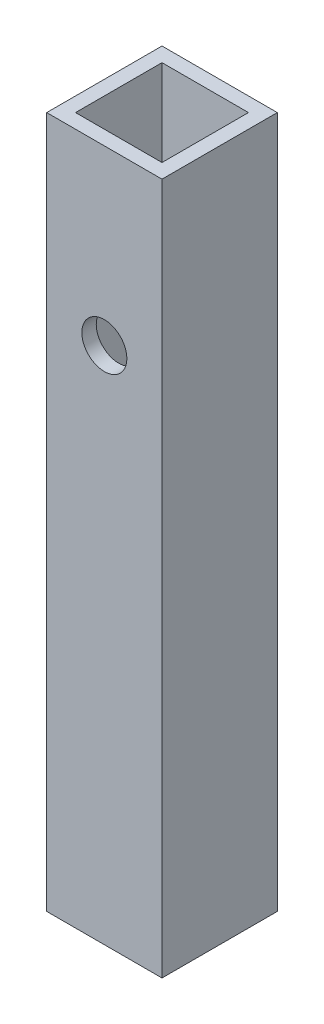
ISO-10303-21;
HEADER;
FILE_DESCRIPTION(('STEP AP214'),'2;1');
FILE_NAME('part.step','',(''),(''),'','','');
FILE_SCHEMA(('AUTOMOTIVE_DESIGN { 1 0 10303 214 1 1 1 1 }'));
ENDSEC;
DATA;
#1=APPLICATION_CONTEXT('core data for automotive mechanical design processes');
#2=APPLICATION_PROTOCOL_DEFINITION('international standard','automotive_design',2000,#1);
#3=PRODUCT_CONTEXT('',#1,'mechanical');
#4=PRODUCT('Part','Part','',(#3));
#5=PRODUCT_RELATED_PRODUCT_CATEGORY('part','',(#4));
#6=PRODUCT_DEFINITION_FORMATION('','',#4);
#7=PRODUCT_DEFINITION_CONTEXT('part definition',#1,'design');
#8=PRODUCT_DEFINITION('design','',#6,#7);
#9=PRODUCT_DEFINITION_SHAPE('','',#8);
#10=(LENGTH_UNIT() NAMED_UNIT(*) SI_UNIT(.MILLI.,.METRE.));
#11=(NAMED_UNIT(*) PLANE_ANGLE_UNIT() SI_UNIT($,.RADIAN.));
#12=(NAMED_UNIT(*) SI_UNIT($,.STERADIAN.) SOLID_ANGLE_UNIT());
#13=UNCERTAINTY_MEASURE_WITH_UNIT(LENGTH_MEASURE(1.E-05),#10,'distance_accuracy_value','');
#14=(GEOMETRIC_REPRESENTATION_CONTEXT(3) GLOBAL_UNCERTAINTY_ASSIGNED_CONTEXT((#13)) GLOBAL_UNIT_ASSIGNED_CONTEXT((#10,
#11,#12)) REPRESENTATION_CONTEXT('',''));
#15=CARTESIAN_POINT('',(0.,0.,0.));
#16=DIRECTION('',(0.,0.,1.));
#17=DIRECTION('',(1.,0.,0.));
#18=AXIS2_PLACEMENT_3D('',#15,#16,#17);
#19=CARTESIAN_POINT('',(-25.4,-304.8,25.4));
#20=DIRECTION('',(-1.,0.,0.));
#21=DIRECTION('',(0.,0.,1.));
#22=AXIS2_PLACEMENT_3D('',#19,#20,#21);
#23=PLANE('',#22);
#24=DIRECTION('',(0.,0.,1.));
#25=VECTOR('',#24,1.);
#26=CARTESIAN_POINT('',(-25.4,0.,25.4));
#27=LINE('',#26,#25);
#28=CARTESIAN_POINT('',(-25.4,0.,-25.4));
#29=VERTEX_POINT('',#28);
#30=CARTESIAN_POINT('',(-25.4,0.,25.4));
#31=VERTEX_POINT('',#30);
#32=EDGE_CURVE('E130',#29,#31,#27,.T.);
#33=ORIENTED_EDGE('',*,*,#32,.F.);
#34=DIRECTION('',(0.,1.,0.));
#35=VECTOR('',#34,1.);
#36=CARTESIAN_POINT('',(-25.4,-304.8,-25.4));
#37=LINE('',#36,#35);
#38=CARTESIAN_POINT('',(-25.4,-304.8,-25.4));
#39=VERTEX_POINT('',#38);
#40=EDGE_CURVE('E11',#39,#29,#37,.T.);
#41=ORIENTED_EDGE('',*,*,#40,.F.);
#42=DIRECTION('',(0.,0.,1.));
#43=VECTOR('',#42,1.);
#44=CARTESIAN_POINT('',(-25.4,-304.8,25.4));
#45=LINE('',#44,#43);
#46=CARTESIAN_POINT('',(-25.4,-304.8,25.4));
#47=VERTEX_POINT('',#46);
#48=EDGE_CURVE('E144',#39,#47,#45,.T.);
#49=ORIENTED_EDGE('',*,*,#48,.T.);
#50=DIRECTION('',(0.,1.,0.));
#51=VECTOR('',#50,1.);
#52=CARTESIAN_POINT('',(-25.4,-304.8,25.4));
#53=LINE('',#52,#51);
#54=EDGE_CURVE('E155',#47,#31,#53,.T.);
#55=ORIENTED_EDGE('',*,*,#54,.T.);
#56=EDGE_LOOP('',(#33,#41,#49,#55));
#57=FACE_BOUND('',#56,.T.);
#58=ADVANCED_FACE('F31',(#57),#23,.T.);
#59=CARTESIAN_POINT('',(-25.4,-304.8,-25.4));
#60=DIRECTION('',(0.,0.,-1.));
#61=DIRECTION('',(-1.,0.,0.));
#62=AXIS2_PLACEMENT_3D('',#59,#60,#61);
#63=PLANE('',#62);
#64=CARTESIAN_POINT('',(0.,-76.2,-25.4));
#65=DIRECTION('',(0.,0.,-1.));
#66=DIRECTION('',(-1.,0.,0.));
#67=AXIS2_PLACEMENT_3D('',#64,#65,#66);
#68=CIRCLE('',#67,9.9187);
#69=CARTESIAN_POINT('',(-9.9187,-76.2,-25.4));
#70=VERTEX_POINT('',#69);
#71=EDGE_CURVE('E272',#70,#70,#68,.T.);
#72=ORIENTED_EDGE('',*,*,#71,.F.);
#73=EDGE_LOOP('',(#72));
#74=FACE_BOUND('',#73,.T.);
#75=DIRECTION('',(-1.,0.,0.));
#76=VECTOR('',#75,1.);
#77=CARTESIAN_POINT('',(-25.4,0.,-25.4));
#78=LINE('',#77,#76);
#79=CARTESIAN_POINT('',(25.4,0.,-25.4));
#80=VERTEX_POINT('',#79);
#81=EDGE_CURVE('E141',#80,#29,#78,.T.);
#82=ORIENTED_EDGE('',*,*,#81,.F.);
#83=DIRECTION('',(0.,1.,0.));
#84=VECTOR('',#83,1.);
#85=CARTESIAN_POINT('',(25.4,-304.8,-25.4));
#86=LINE('',#85,#84);
#87=CARTESIAN_POINT('',(25.4,-304.8,-25.4));
#88=VERTEX_POINT('',#87);
#89=EDGE_CURVE('E39',#88,#80,#86,.T.);
#90=ORIENTED_EDGE('',*,*,#89,.F.);
#91=DIRECTION('',(-1.,0.,0.));
#92=VECTOR('',#91,1.);
#93=CARTESIAN_POINT('',(-25.4,-304.8,-25.4));
#94=LINE('',#93,#92);
#95=EDGE_CURVE('E153',#88,#39,#94,.T.);
#96=ORIENTED_EDGE('',*,*,#95,.T.);
#97=ORIENTED_EDGE('',*,*,#40,.T.);
#98=EDGE_LOOP('',(#82,#90,#96,#97));
#99=FACE_BOUND('',#98,.T.);
#100=ADVANCED_FACE('F169',(#74,#99),#63,.T.);
#101=CARTESIAN_POINT('',(25.4,-304.8,25.4));
#102=DIRECTION('',(1.,0.,0.));
#103=DIRECTION('',(0.,0.,-1.));
#104=AXIS2_PLACEMENT_3D('',#101,#102,#103);
#105=PLANE('',#104);
#106=DIRECTION('',(0.,0.,-1.));
#107=VECTOR('',#106,1.);
#108=CARTESIAN_POINT('',(25.4,0.,25.4));
#109=LINE('',#108,#107);
#110=CARTESIAN_POINT('',(25.4,0.,25.4));
#111=VERTEX_POINT('',#110);
#112=EDGE_CURVE('E138',#111,#80,#109,.T.);
#113=ORIENTED_EDGE('',*,*,#112,.F.);
#114=DIRECTION('',(0.,1.,0.));
#115=VECTOR('',#114,1.);
#116=CARTESIAN_POINT('',(25.4,-304.8,25.4));
#117=LINE('',#116,#115);
#118=CARTESIAN_POINT('',(25.4,-304.8,25.4));
#119=VERTEX_POINT('',#118);
#120=EDGE_CURVE('E158',#119,#111,#117,.T.);
#121=ORIENTED_EDGE('',*,*,#120,.F.);
#122=DIRECTION('',(0.,0.,-1.));
#123=VECTOR('',#122,1.);
#124=CARTESIAN_POINT('',(25.4,-304.8,25.4));
#125=LINE('',#124,#123);
#126=EDGE_CURVE('E150',#119,#88,#125,.T.);
#127=ORIENTED_EDGE('',*,*,#126,.T.);
#128=ORIENTED_EDGE('',*,*,#89,.T.);
#129=EDGE_LOOP('',(#113,#121,#127,#128));
#130=FACE_BOUND('',#129,.T.);
#131=ADVANCED_FACE('F175',(#130),#105,.T.);
#132=CARTESIAN_POINT('',(-25.4,-304.8,25.4));
#133=DIRECTION('',(0.,0.,1.));
#134=DIRECTION('',(1.,0.,0.));
#135=AXIS2_PLACEMENT_3D('',#132,#133,#134);
#136=PLANE('',#135);
#137=CARTESIAN_POINT('',(0.,-76.2,25.4));
#138=DIRECTION('',(0.,0.,-1.));
#139=DIRECTION('',(-1.,0.,0.));
#140=AXIS2_PLACEMENT_3D('',#137,#138,#139);
#141=CIRCLE('',#140,9.9187);
#142=CARTESIAN_POINT('',(-9.9187,-76.2,25.4));
#143=VERTEX_POINT('',#142);
#144=EDGE_CURVE('E269',#143,#143,#141,.T.);
#145=ORIENTED_EDGE('',*,*,#144,.T.);
#146=EDGE_LOOP('',(#145));
#147=FACE_BOUND('',#146,.T.);
#148=DIRECTION('',(1.,0.,0.));
#149=VECTOR('',#148,1.);
#150=CARTESIAN_POINT('',(-25.4,0.,25.4));
#151=LINE('',#150,#149);
#152=EDGE_CURVE('E135',#31,#111,#151,.T.);
#153=ORIENTED_EDGE('',*,*,#152,.F.);
#154=ORIENTED_EDGE('',*,*,#54,.F.);
#155=DIRECTION('',(1.,0.,0.));
#156=VECTOR('',#155,1.);
#157=CARTESIAN_POINT('',(-25.4,-304.8,25.4));
#158=LINE('',#157,#156);
#159=EDGE_CURVE('E147',#47,#119,#158,.T.);
#160=ORIENTED_EDGE('',*,*,#159,.T.);
#161=ORIENTED_EDGE('',*,*,#120,.T.);
#162=EDGE_LOOP('',(#153,#154,#160,#161));
#163=FACE_BOUND('',#162,.T.);
#164=ADVANCED_FACE('F165',(#147,#163),#136,.T.);
#165=CARTESIAN_POINT('',(-25.4,-304.8,-25.4));
#166=DIRECTION('',(0.,-1.,0.));
#167=DIRECTION('',(0.,0.,-1.));
#168=AXIS2_PLACEMENT_3D('',#165,#166,#167);
#169=PLANE('',#168);
#170=DIRECTION('',(1.,0.,0.));
#171=VECTOR('',#170,1.);
#172=CARTESIAN_POINT('',(-19.05,-304.8,19.05));
#173=LINE('',#172,#171);
#174=CARTESIAN_POINT('',(-19.05,-304.8,19.05));
#175=VERTEX_POINT('',#174);
#176=CARTESIAN_POINT('',(19.05,-304.8,19.05));
#177=VERTEX_POINT('',#176);
#178=EDGE_CURVE('E116',#175,#177,#173,.T.);
#179=ORIENTED_EDGE('',*,*,#178,.T.);
#180=DIRECTION('',(0.,0.,-1.));
#181=VECTOR('',#180,1.);
#182=CARTESIAN_POINT('',(19.05,-304.8,19.05));
#183=LINE('',#182,#181);
#184=CARTESIAN_POINT('',(19.05,-304.8,-19.05));
#185=VERTEX_POINT('',#184);
#186=EDGE_CURVE('E122',#177,#185,#183,.T.);
#187=ORIENTED_EDGE('',*,*,#186,.T.);
#188=DIRECTION('',(-1.,0.,0.));
#189=VECTOR('',#188,1.);
#190=CARTESIAN_POINT('',(-19.05,-304.8,-19.05));
#191=LINE('',#190,#189);
#192=CARTESIAN_POINT('',(-19.05,-304.8,-19.05));
#193=VERTEX_POINT('',#192);
#194=EDGE_CURVE('E47',#185,#193,#191,.T.);
#195=ORIENTED_EDGE('',*,*,#194,.T.);
#196=DIRECTION('',(0.,0.,1.));
#197=VECTOR('',#196,1.);
#198=CARTESIAN_POINT('',(-19.05,-304.8,19.05));
#199=LINE('',#198,#197);
#200=EDGE_CURVE('E125',#193,#175,#199,.T.);
#201=ORIENTED_EDGE('',*,*,#200,.T.);
#202=EDGE_LOOP('',(#179,#187,#195,#201));
#203=FACE_BOUND('',#202,.T.);
#204=ORIENTED_EDGE('',*,*,#48,.F.);
#205=ORIENTED_EDGE('',*,*,#95,.F.);
#206=ORIENTED_EDGE('',*,*,#126,.F.);
#207=ORIENTED_EDGE('',*,*,#159,.F.);
#208=EDGE_LOOP('',(#204,#205,#206,#207));
#209=FACE_BOUND('',#208,.T.);
#210=ADVANCED_FACE('F172',(#203,#209),#169,.T.);
#211=CARTESIAN_POINT('',(-25.4,0.,-25.4));
#212=DIRECTION('',(0.,-1.,0.));
#213=DIRECTION('',(0.,0.,-1.));
#214=AXIS2_PLACEMENT_3D('',#211,#212,#213);
#215=PLANE('',#214);
#216=DIRECTION('',(0.,0.,-1.));
#217=VECTOR('',#216,1.);
#218=CARTESIAN_POINT('',(19.05,0.,19.05));
#219=LINE('',#218,#217);
#220=CARTESIAN_POINT('',(19.05,0.,19.05));
#221=VERTEX_POINT('',#220);
#222=CARTESIAN_POINT('',(19.05,0.,-19.05));
#223=VERTEX_POINT('',#222);
#224=EDGE_CURVE('E107',#221,#223,#219,.T.);
#225=ORIENTED_EDGE('',*,*,#224,.F.);
#226=DIRECTION('',(1.,0.,0.));
#227=VECTOR('',#226,1.);
#228=CARTESIAN_POINT('',(-19.05,0.,19.05));
#229=LINE('',#228,#227);
#230=CARTESIAN_POINT('',(-19.05,0.,19.05));
#231=VERTEX_POINT('',#230);
#232=EDGE_CURVE('E55',#231,#221,#229,.T.);
#233=ORIENTED_EDGE('',*,*,#232,.F.);
#234=DIRECTION('',(0.,0.,1.));
#235=VECTOR('',#234,1.);
#236=CARTESIAN_POINT('',(-19.05,0.,19.05));
#237=LINE('',#236,#235);
#238=CARTESIAN_POINT('',(-19.05,0.,-19.05));
#239=VERTEX_POINT('',#238);
#240=EDGE_CURVE('E114',#239,#231,#237,.T.);
#241=ORIENTED_EDGE('',*,*,#240,.F.);
#242=DIRECTION('',(-1.,0.,0.));
#243=VECTOR('',#242,1.);
#244=CARTESIAN_POINT('',(-19.05,0.,-19.05));
#245=LINE('',#244,#243);
#246=EDGE_CURVE('E98',#223,#239,#245,.T.);
#247=ORIENTED_EDGE('',*,*,#246,.F.);
#248=EDGE_LOOP('',(#225,#233,#241,#247));
#249=FACE_BOUND('',#248,.T.);
#250=ORIENTED_EDGE('',*,*,#32,.T.);
#251=ORIENTED_EDGE('',*,*,#152,.T.);
#252=ORIENTED_EDGE('',*,*,#112,.T.);
#253=ORIENTED_EDGE('',*,*,#81,.T.);
#254=EDGE_LOOP('',(#250,#251,#252,#253));
#255=FACE_BOUND('',#254,.T.);
#256=ADVANCED_FACE('F111',(#249,#255),#215,.F.);
#257=CARTESIAN_POINT('',(-19.05,-304.8,19.05));
#258=DIRECTION('',(0.,0.,1.));
#259=DIRECTION('',(1.,0.,0.));
#260=AXIS2_PLACEMENT_3D('',#257,#258,#259);
#261=PLANE('',#260);
#262=CARTESIAN_POINT('',(0.,-76.2,19.05));
#263=DIRECTION('',(0.,0.,1.));
#264=DIRECTION('',(1.,0.,0.));
#265=AXIS2_PLACEMENT_3D('',#262,#263,#264);
#266=CIRCLE('',#265,9.9187);
#267=CARTESIAN_POINT('',(9.9187,-76.2,19.05));
#268=VERTEX_POINT('',#267);
#269=EDGE_CURVE('E265',#268,#268,#266,.T.);
#270=ORIENTED_EDGE('',*,*,#269,.T.);
#271=EDGE_LOOP('',(#270));
#272=FACE_BOUND('',#271,.T.);
#273=ORIENTED_EDGE('',*,*,#232,.T.);
#274=DIRECTION('',(0.,1.,0.));
#275=VECTOR('',#274,1.);
#276=CARTESIAN_POINT('',(19.05,-304.8,19.05));
#277=LINE('',#276,#275);
#278=EDGE_CURVE('E104',#177,#221,#277,.T.);
#279=ORIENTED_EDGE('',*,*,#278,.F.);
#280=ORIENTED_EDGE('',*,*,#178,.F.);
#281=DIRECTION('',(0.,1.,0.));
#282=VECTOR('',#281,1.);
#283=CARTESIAN_POINT('',(-19.05,-304.8,19.05));
#284=LINE('',#283,#282);
#285=EDGE_CURVE('E128',#175,#231,#284,.T.);
#286=ORIENTED_EDGE('',*,*,#285,.T.);
#287=EDGE_LOOP('',(#273,#279,#280,#286));
#288=FACE_BOUND('',#287,.T.);
#289=ADVANCED_FACE('F211',(#272,#288),#261,.F.);
#290=CARTESIAN_POINT('',(-19.05,-304.8,19.05));
#291=DIRECTION('',(-1.,0.,0.));
#292=DIRECTION('',(0.,0.,1.));
#293=AXIS2_PLACEMENT_3D('',#290,#291,#292);
#294=PLANE('',#293);
#295=ORIENTED_EDGE('',*,*,#240,.T.);
#296=ORIENTED_EDGE('',*,*,#285,.F.);
#297=ORIENTED_EDGE('',*,*,#200,.F.);
#298=DIRECTION('',(0.,1.,0.));
#299=VECTOR('',#298,1.);
#300=CARTESIAN_POINT('',(-19.05,-304.8,-19.05));
#301=LINE('',#300,#299);
#302=EDGE_CURVE('E103',#193,#239,#301,.T.);
#303=ORIENTED_EDGE('',*,*,#302,.T.);
#304=EDGE_LOOP('',(#295,#296,#297,#303));
#305=FACE_BOUND('',#304,.T.);
#306=ADVANCED_FACE('F216',(#305),#294,.F.);
#307=CARTESIAN_POINT('',(-19.05,-304.8,-19.05));
#308=DIRECTION('',(0.,0.,-1.));
#309=DIRECTION('',(-1.,0.,0.));
#310=AXIS2_PLACEMENT_3D('',#307,#308,#309);
#311=PLANE('',#310);
#312=CARTESIAN_POINT('',(0.,-76.2,-19.05));
#313=DIRECTION('',(0.,0.,-1.));
#314=DIRECTION('',(-1.,0.,0.));
#315=AXIS2_PLACEMENT_3D('',#312,#313,#314);
#316=CIRCLE('',#315,9.9187);
#317=CARTESIAN_POINT('',(-9.9187,-76.2,-19.05));
#318=VERTEX_POINT('',#317);
#319=EDGE_CURVE('E34',#318,#318,#316,.T.);
#320=ORIENTED_EDGE('',*,*,#319,.T.);
#321=EDGE_LOOP('',(#320));
#322=FACE_BOUND('',#321,.T.);
#323=ORIENTED_EDGE('',*,*,#246,.T.);
#324=ORIENTED_EDGE('',*,*,#302,.F.);
#325=ORIENTED_EDGE('',*,*,#194,.F.);
#326=DIRECTION('',(0.,1.,0.));
#327=VECTOR('',#326,1.);
#328=CARTESIAN_POINT('',(19.05,-304.8,-19.05));
#329=LINE('',#328,#327);
#330=EDGE_CURVE('E94',#185,#223,#329,.T.);
#331=ORIENTED_EDGE('',*,*,#330,.T.);
#332=EDGE_LOOP('',(#323,#324,#325,#331));
#333=FACE_BOUND('',#332,.T.);
#334=ADVANCED_FACE('F96',(#322,#333),#311,.F.);
#335=CARTESIAN_POINT('',(19.05,-304.8,19.05));
#336=DIRECTION('',(1.,0.,0.));
#337=DIRECTION('',(0.,0.,-1.));
#338=AXIS2_PLACEMENT_3D('',#335,#336,#337);
#339=PLANE('',#338);
#340=ORIENTED_EDGE('',*,*,#224,.T.);
#341=ORIENTED_EDGE('',*,*,#330,.F.);
#342=ORIENTED_EDGE('',*,*,#186,.F.);
#343=ORIENTED_EDGE('',*,*,#278,.T.);
#344=EDGE_LOOP('',(#340,#341,#342,#343));
#345=FACE_BOUND('',#344,.T.);
#346=ADVANCED_FACE('F108',(#345),#339,.F.);
#347=CARTESIAN_POINT('',(0.,-76.2,25.4));
#348=DIRECTION('',(0.,0.,-1.));
#349=DIRECTION('',(-1.,0.,0.));
#350=AXIS2_PLACEMENT_3D('',#347,#348,#349);
#351=CYLINDRICAL_SURFACE('',#350,9.9187);
#352=ORIENTED_EDGE('',*,*,#71,.T.);
#353=EDGE_LOOP('',(#352));
#354=FACE_BOUND('',#353,.T.);
#355=ORIENTED_EDGE('',*,*,#319,.F.);
#356=EDGE_LOOP('',(#355));
#357=FACE_BOUND('',#356,.T.);
#358=ADVANCED_FACE('F235',(#354,#357),#351,.F.);
#359=ORIENTED_EDGE('',*,*,#144,.F.);
#360=EDGE_LOOP('',(#359));
#361=FACE_BOUND('',#360,.T.);
#362=ORIENTED_EDGE('',*,*,#269,.F.);
#363=EDGE_LOOP('',(#362));
#364=FACE_BOUND('',#363,.T.);
#365=ADVANCED_FACE('F240',(#361,#364),#351,.F.);
#366=CLOSED_SHELL('',(#58,#100,#131,#164,#210,#256,#289,#306,#334,#346,#358,#365));
#367=MANIFOLD_SOLID_BREP('B2',#366);
#368=ADVANCED_BREP_SHAPE_REPRESENTATION('',(#18,#367),#14);
#369=SHAPE_DEFINITION_REPRESENTATION(#9,#368);
ENDSEC;
END-ISO-10303-21;
